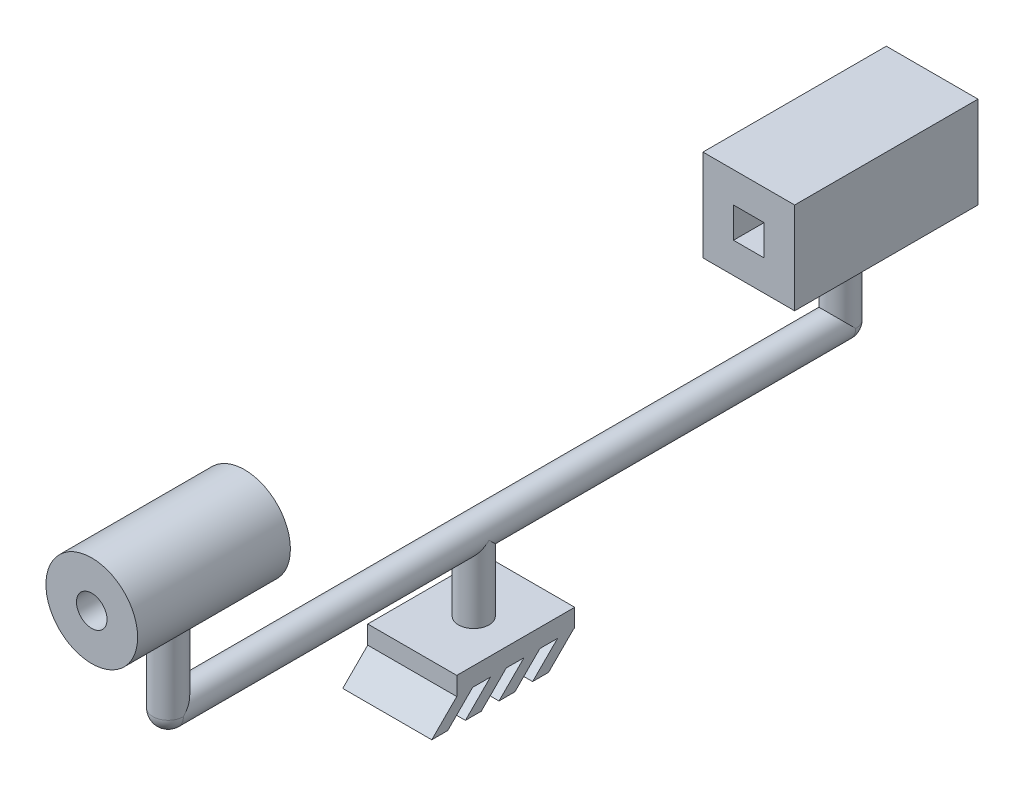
from build123d import *

# Parameters (mm, degrees)
ESQUISSE1_R             = 2.5
BASE_EXTRUSION_DEPTH    = 12
BOSS_EXTRU_1_DEPTH      = 50
BOSS_EXTRU_1_DEPTH_BACK = 60
ESQUISSE2_R             = 2.5
ESQUISSE3_R             = 2.5
BOSS_EXTRU_2_DEPTH      = 20
ESQUISSE4_R             = 2.5
BOSS_EXTRU_3_DEPTH      = 20
BOSS_EXTRU_4_DEPTH      = 7.5
BOSS_EXTRU_4_DEPTH_BACK = 7.5
ESQUISSE5_W             = 30
ESQUISSE5_H             = 15
ESQUISSE6_W             = 25
ESQUISSE6_H             = 7.5
ENL_V_MAT_EXTRU_1_REACH = 142.423
ESQUISSE7_R             = 2.5
ESQUISSE8_W             = 5
ESQUISSE8_H             = 5
ENL_V_MAT_EXTRU_2_DEPTH = 52.5
ESQUISSE9_W             = 14.568669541
ESQUISSE9_H             = 19.303487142
BOSS_EXTRU_5_DEPTH      = 3
EXTRUSION1_DEPTH        = 14.568669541


with BuildPart() as part:
    # Esquisse1 → Base-Extrusion (new body)
    with BuildSketch(Plane(origin=(0, 0, 0), x_dir=(1, 0, 0), z_dir=(0, 1, 0))):
        with Locations(Location((0, 0, 0), (0, 0, 270))):
            Circle(ESQUISSE1_R)
    extrude(amount=-BASE_EXTRUSION_DEPTH)

    # Esquisse2 → Boss.-Extru.1 (add, two sides: drawn at the far end of the back side and taken through both)
    with BuildSketch(Plane.XY.offset(-BOSS_EXTRU_1_DEPTH_BACK)):
        Circle(ESQUISSE2_R)
    extrude(amount=BOSS_EXTRU_1_DEPTH + BOSS_EXTRU_1_DEPTH_BACK)

    # Esquisse3 → Boss.-Extru.2 (add)
    with BuildSketch(Plane(origin=(0, 0, 0), x_dir=(1, 0, 0), z_dir=(0, 1, 0))):
        with Locations(Location((0, 60, 0), (0, 0, 180))):
            Circle(ESQUISSE3_R)
    extrude(amount=BOSS_EXTRU_2_DEPTH)

    # Esquisse4 → Boss.-Extru.3 (add)
    with BuildSketch(Plane(origin=(0, 0, 0), x_dir=(1, 0, 0), z_dir=(0, 1, 0))):
        with Locations((0, -50)):
            Circle(ESQUISSE4_R)
    extrude(amount=BOSS_EXTRU_3_DEPTH)

    # Esquisse5 → Boss.-Extru.4 (add, two sides: drawn at the far end of the back side and taken through both)
    with BuildSketch(Plane(origin=(0, 0, 0), x_dir=(0, 0, -1), z_dir=(1, 0, 0)).offset(-BOSS_EXTRU_4_DEPTH_BACK)):
        with Locations((60, 20)):
            Rectangle(ESQUISSE5_W, ESQUISSE5_H)
    extrude(amount=BOSS_EXTRU_4_DEPTH + BOSS_EXTRU_4_DEPTH_BACK)

    # Esquisse6 → Boss.-R_vol.1 (revolve)
    with BuildSketch(Plane(origin=(0, 0, 0), x_dir=(0, 0, -1), z_dir=(1, 0, 0)), mode=Mode.PRIVATE) as boss_r_vol_1_sk:
        with Locations((-50, 23.75)):
            Rectangle(ESQUISSE6_W, ESQUISSE6_H)
    revolve(boss_r_vol_1_sk.sketch.rotate(Axis((0, 20, 49.211393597), (0, 0, -1)), 90), axis=Axis((0, 20, 49.211393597), (0, 0, -1)))

    # Esquisse7 → Enl_v. mat.-Extru.1 (cut, up to next)
    with BuildSketch(Plane.XY.offset(62.5), mode=Mode.PRIVATE) as enl_v_mat_extru_1_sk1:
        with Locations((0, 20)):
            Circle(ESQUISSE7_R)
    enl_v_mat_extru_1_tool1 = extrude(enl_v_mat_extru_1_sk1.sketch, amount=-ENL_V_MAT_EXTRU_1_REACH, mode=Mode.PRIVATE) & part.part
    add(enl_v_mat_extru_1_tool1.solids().sort_by_distance((0, 20, 62.5))[0], mode=Mode.SUBTRACT)

    # Esquisse8 → Enl_v. mat.-Extru.2 (cut)
    with BuildSketch(Plane.XY.offset(-45)):
        with Locations((0, 20)):
            Rectangle(ESQUISSE8_W, ESQUISSE8_H)
    extrude(amount=-ENL_V_MAT_EXTRU_2_DEPTH, mode=Mode.SUBTRACT)

    # Esquisse9 → Boss.-Extru.5 (add)
    with BuildSketch(Plane.XZ.offset(12)):
        with Locations((-0.273162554, 0.14159331)):
            Rectangle(ESQUISSE9_W, ESQUISSE9_H)
    extrude(amount=BOSS_EXTRU_5_DEPTH)

    # Esquisse10 → Boss.-R_vol.2 (revolve)
    with BuildSketch(Plane.XY.offset(50)):
        with BuildLine():
            Line((2.5, 0), (-2.5, 0))
            ThreePointArc((-2.5, 0), (0, -2.5), (2.5, 0))
        make_face()
    revolve(axis=Axis((-12.218148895, 0, 50), (1, 0, 0)))

    # Esquisse11 → Boss.-R_vol.3 (revolve)
    with BuildSketch(Plane(origin=(0, 0, -60), x_dir=(-1, 0, 0), z_dir=(0, 0, -1))):
        with BuildLine():
            Line((2.5, 0), (-2.5, 0))
            ThreePointArc((-2.5, 0), (0, -2.5), (2.5, 0))
        make_face()
    revolve(axis=Axis((-11.799220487, 0, -60), (1, 0, 0)))

    # Esquisse12 → Extrusion1 (add)
    with BuildSketch(Plane(origin=(7.011172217, 0, 0), x_dir=(0, 0, -1), z_dir=(1, 0, 0))):
        Polygon((-9.793336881, -15), (-13.879825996, -19.086489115), (-11.277872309, -19.086489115), (-7.191383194, -15), align=None)
        Polygon((-4.293336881, -15), (-8.379825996, -19.086489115), (-5.777872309, -19.086489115), (-1.691383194, -15), align=None)
        Polygon((1.206663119, -15), (-2.879825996, -19.086489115), (-0.277872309, -19.086489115), (3.808616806, -15), align=None)
        Polygon((6.706663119, -15), (2.620174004, -19.086489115), (5.222127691, -19.086489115), (9.308616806, -15), align=None)
    extrude(amount=-EXTRUSION1_DEPTH)


solid = part.part
